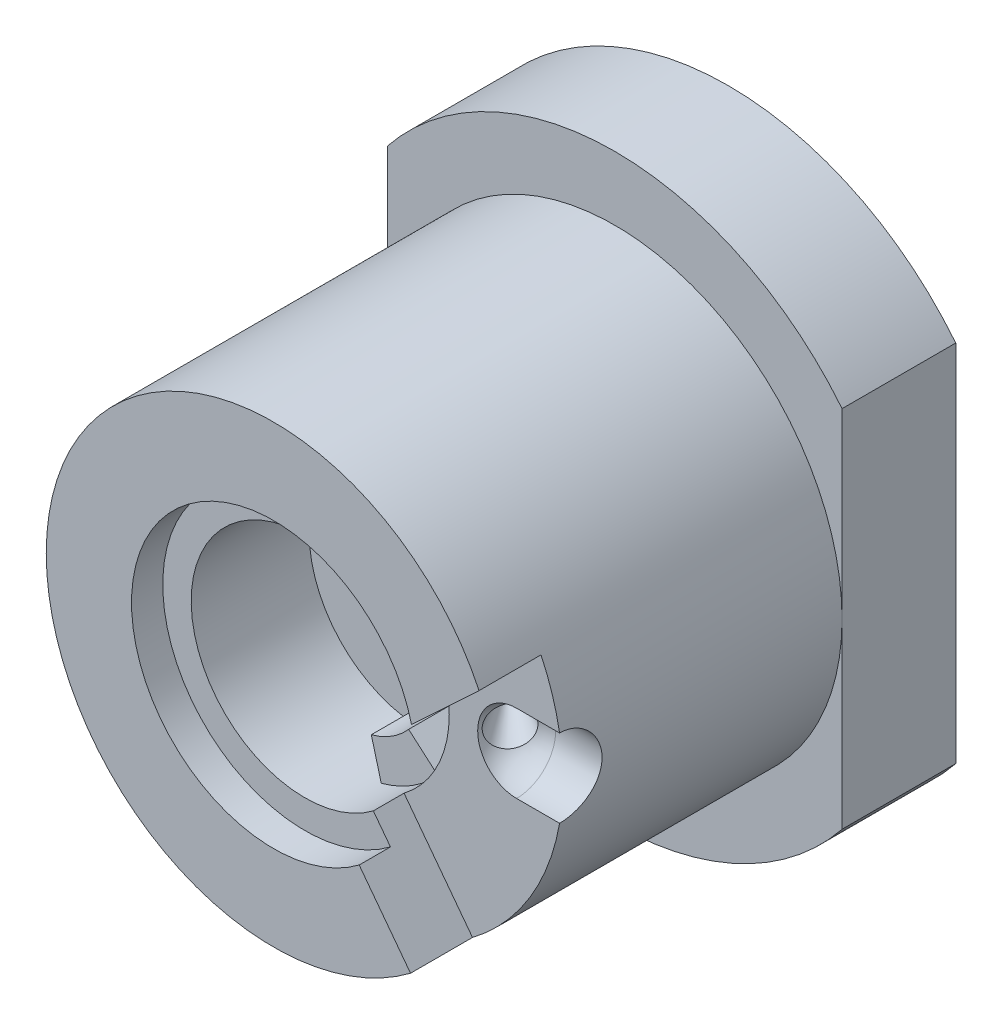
ISO-10303-21;
HEADER;
FILE_DESCRIPTION(('STEP AP214'),'2;1');
FILE_NAME('part.step','',(''),(''),'','','');
FILE_SCHEMA(('AUTOMOTIVE_DESIGN { 1 0 10303 214 1 1 1 1 }'));
ENDSEC;
DATA;
#1=APPLICATION_CONTEXT('core data for automotive mechanical design processes');
#2=APPLICATION_PROTOCOL_DEFINITION('international standard','automotive_design',2000,#1);
#3=PRODUCT_CONTEXT('',#1,'mechanical');
#4=PRODUCT('Part','Part','',(#3));
#5=PRODUCT_RELATED_PRODUCT_CATEGORY('part','',(#4));
#6=PRODUCT_DEFINITION_FORMATION('','',#4);
#7=PRODUCT_DEFINITION_CONTEXT('part definition',#1,'design');
#8=PRODUCT_DEFINITION('design','',#6,#7);
#9=PRODUCT_DEFINITION_SHAPE('','',#8);
#10=(LENGTH_UNIT() NAMED_UNIT(*) SI_UNIT(.MILLI.,.METRE.));
#11=(NAMED_UNIT(*) PLANE_ANGLE_UNIT() SI_UNIT($,.RADIAN.));
#12=(NAMED_UNIT(*) SI_UNIT($,.STERADIAN.) SOLID_ANGLE_UNIT());
#13=UNCERTAINTY_MEASURE_WITH_UNIT(LENGTH_MEASURE(1.E-05),#10,'distance_accuracy_value','');
#14=(GEOMETRIC_REPRESENTATION_CONTEXT(3) GLOBAL_UNCERTAINTY_ASSIGNED_CONTEXT((#13)) GLOBAL_UNIT_ASSIGNED_CONTEXT((#10,
#11,#12)) REPRESENTATION_CONTEXT('',''));
#15=CARTESIAN_POINT('',(0.,0.,0.));
#16=DIRECTION('',(0.,0.,1.));
#17=DIRECTION('',(1.,0.,0.));
#18=AXIS2_PLACEMENT_3D('',#15,#16,#17);
#19=CARTESIAN_POINT('',(0.,0.,13.5));
#20=DIRECTION('',(0.,0.,1.));
#21=DIRECTION('',(1.,0.,0.));
#22=AXIS2_PLACEMENT_3D('',#19,#20,#21);
#23=CYLINDRICAL_SURFACE('',#22,8.);
#24=DIRECTION('',(0.,0.,-1.));
#25=VECTOR('',#24,1.);
#26=CARTESIAN_POINT('',(6.03993550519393,-5.24587257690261,18.5));
#27=LINE('',#26,#25);
#28=CARTESIAN_POINT('',(6.03993550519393,-5.24587257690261,18.5));
#29=VERTEX_POINT('',#28);
#30=CARTESIAN_POINT('',(6.03993550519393,-5.24587257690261,13.5));
#31=VERTEX_POINT('',#30);
#32=EDGE_CURVE('E709',#29,#31,#27,.T.);
#33=ORIENTED_EDGE('',*,*,#32,.F.);
#34=CARTESIAN_POINT('',(0.,0.,18.5));
#35=DIRECTION('',(0.,0.,1.));
#36=DIRECTION('',(1.,0.,0.));
#37=AXIS2_PLACEMENT_3D('',#34,#35,#36);
#38=CIRCLE('',#37,8.);
#39=CARTESIAN_POINT('',(2.07387875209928,-7.72651453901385,18.5));
#40=VERTEX_POINT('',#39);
#41=EDGE_CURVE('E851',#40,#29,#38,.T.);
#42=ORIENTED_EDGE('',*,*,#41,.F.);
#43=DIRECTION('',(0.,0.,-1.));
#44=VECTOR('',#43,1.);
#45=CARTESIAN_POINT('',(2.07387875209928,-7.72651453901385,18.5));
#46=LINE('',#45,#44);
#47=CARTESIAN_POINT('',(2.07387875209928,-7.72651453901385,13.5));
#48=VERTEX_POINT('',#47);
#49=EDGE_CURVE('E842',#40,#48,#46,.T.);
#50=ORIENTED_EDGE('',*,*,#49,.T.);
#51=CARTESIAN_POINT('',(0.,0.,13.5));
#52=DIRECTION('',(0.,0.,1.));
#53=DIRECTION('',(1.,0.,0.));
#54=AXIS2_PLACEMENT_3D('',#51,#52,#53);
#55=CIRCLE('',#54,8.);
#56=EDGE_CURVE('E704',#31,#48,#55,.T.);
#57=ORIENTED_EDGE('',*,*,#56,.F.);
#58=EDGE_LOOP('',(#33,#42,#50,#57));
#59=FACE_BOUND('',#58,.T.);
#60=DIRECTION('',(0.,0.,1.));
#61=VECTOR('',#60,1.);
#62=CARTESIAN_POINT('',(7.96012546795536,0.797748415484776,13.5));
#63=LINE('',#62,#61);
#64=CARTESIAN_POINT('',(7.96012546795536,0.797748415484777,21.8));
#65=VERTEX_POINT('',#64);
#66=CARTESIAN_POINT('',(7.96012546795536,0.797748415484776,19.64));
#67=VERTEX_POINT('',#66);
#68=EDGE_CURVE('E700',#65,#67,#63,.F.);
#69=ORIENTED_EDGE('',*,*,#68,.F.);
#70=CARTESIAN_POINT('',(0.,0.,21.8));
#71=DIRECTION('',(0.,0.,1.));
#72=DIRECTION('',(1.,0.,0.));
#73=AXIS2_PLACEMENT_3D('',#70,#71,#72);
#74=CIRCLE('',#73,8.);
#75=CARTESIAN_POINT('',(4.81727018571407,-6.38701087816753,21.8));
#76=VERTEX_POINT('',#75);
#77=EDGE_CURVE('E690',#65,#76,#74,.T.);
#78=ORIENTED_EDGE('',*,*,#77,.T.);
#79=DIRECTION('',(0.,0.,1.));
#80=VECTOR('',#79,1.);
#81=CARTESIAN_POINT('',(4.81727018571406,-6.38701087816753,13.5));
#82=LINE('',#81,#80);
#83=CARTESIAN_POINT('',(4.81727018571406,-6.38701087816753,19.64));
#84=VERTEX_POINT('',#83);
#85=EDGE_CURVE('E703',#84,#76,#82,.T.);
#86=ORIENTED_EDGE('',*,*,#85,.F.);
#87=CARTESIAN_POINT('',(0.,0.,19.64));
#88=DIRECTION('',(0.,0.,-1.));
#89=DIRECTION('',(-1.,0.,0.));
#90=AXIS2_PLACEMENT_3D('',#87,#88,#89);
#91=CIRCLE('',#90,8.);
#92=EDGE_CURVE('E622',#67,#84,#91,.T.);
#93=ORIENTED_EDGE('',*,*,#92,.F.);
#94=EDGE_LOOP('',(#69,#78,#86,#93));
#95=FACE_BOUND('',#94,.T.);
#96=CARTESIAN_POINT('',(7.99834418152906,-0.162756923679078,15.030893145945));
#97=CARTESIAN_POINT('',(7.99804089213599,-0.17766315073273,15.0447095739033));
#98=CARTESIAN_POINT('',(7.99772346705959,-0.191230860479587,15.0599867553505));
#99=CARTESIAN_POINT('',(7.99709907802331,-0.215772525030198,15.0925420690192));
#100=CARTESIAN_POINT('',(7.99679216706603,-0.226734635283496,15.1098288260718));
#101=CARTESIAN_POINT('',(7.99609880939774,-0.250187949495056,15.1530490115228));
#102=CARTESIAN_POINT('',(7.99573098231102,-0.26147906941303,15.1796332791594));
#103=CARTESIAN_POINT('',(7.99511354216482,-0.279715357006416,15.2342207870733));
#104=CARTESIAN_POINT('',(7.99486404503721,-0.286656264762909,15.2622253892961));
#105=CARTESIAN_POINT('',(7.99445546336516,-0.297864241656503,15.3263707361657));
#106=CARTESIAN_POINT('',(7.99433726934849,-0.30095214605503,15.3627185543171));
#107=CARTESIAN_POINT('',(7.99433010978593,-0.301140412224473,15.4354406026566));
#108=CARTESIAN_POINT('',(7.99444128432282,-0.298237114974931,15.4718148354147));
#109=CARTESIAN_POINT('',(7.99484122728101,-0.287293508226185,15.5379271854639));
#110=CARTESIAN_POINT('',(7.99509942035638,-0.280129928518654,15.5678116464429));
#111=CARTESIAN_POINT('',(7.99574109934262,-0.26118279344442,15.6260731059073));
#112=CARTESIAN_POINT('',(7.99612431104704,-0.249409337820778,15.6544532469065));
#113=CARTESIAN_POINT('',(7.99681716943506,-0.225828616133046,15.6988258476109));
#114=CARTESIAN_POINT('',(7.99710424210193,-0.215533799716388,15.7156238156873));
#115=CARTESIAN_POINT('',(7.99768932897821,-0.192606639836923,15.7475567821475));
#116=CARTESIAN_POINT('',(7.99798732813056,-0.179977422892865,15.7626939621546));
#117=CARTESIAN_POINT('',(7.99849252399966,-0.155647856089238,15.7870791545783));
#118=CARTESIAN_POINT('',(7.99870401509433,-0.144484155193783,15.7968596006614));
#119=CARTESIAN_POINT('',(7.99909750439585,-0.120745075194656,15.8145354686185));
#120=CARTESIAN_POINT('',(7.99927954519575,-0.108171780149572,15.8224336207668));
#121=CARTESIAN_POINT('',(7.9995627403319,-0.084317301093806,15.8344884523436));
#122=CARTESIAN_POINT('',(7.99967272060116,-0.0732536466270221,15.8390727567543));
#123=CARTESIAN_POINT('',(7.9998485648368,-0.0505148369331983,15.8463370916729));
#124=CARTESIAN_POINT('',(7.99991446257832,-0.0388401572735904,15.8490185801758));
#125=CARTESIAN_POINT('',(7.99999446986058,-0.0151427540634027,15.8522682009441));
#126=CARTESIAN_POINT('',(8.00000835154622,-0.00311873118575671,15.8528270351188));
#127=CARTESIAN_POINT('',(7.99998184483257,0.020830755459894,15.8517542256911));
#128=CARTESIAN_POINT('',(7.99994145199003,0.0327562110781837,15.8501224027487));
#129=CARTESIAN_POINT('',(7.99981588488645,0.0553669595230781,15.8449876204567));
#130=CARTESIAN_POINT('',(7.99973381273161,0.0660823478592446,15.8416140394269));
#131=CARTESIAN_POINT('',(7.99953496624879,0.0868834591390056,15.833305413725));
#132=CARTESIAN_POINT('',(7.99941817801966,0.0969689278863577,15.8283697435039));
#133=CARTESIAN_POINT('',(7.99910343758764,0.120571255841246,15.8147794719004));
#134=CARTESIAN_POINT('',(7.99889220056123,0.133692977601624,15.8054389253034));
#135=CARTESIAN_POINT('',(7.9984437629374,0.158269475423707,15.784776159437));
#136=CARTESIAN_POINT('',(7.99820650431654,0.169720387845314,15.7734494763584));
#137=CARTESIAN_POINT('',(7.99761972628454,0.195747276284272,15.7439749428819));
#138=CARTESIAN_POINT('',(7.99726745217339,0.209430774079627,15.7250418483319));
#139=CARTESIAN_POINT('',(7.99659548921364,0.233681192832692,15.6852909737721));
#140=CARTESIAN_POINT('',(7.99627586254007,0.244242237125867,15.6644697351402));
#141=CARTESIAN_POINT('',(7.9955733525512,0.266419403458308,15.6125406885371));
#142=CARTESIAN_POINT('',(7.9952210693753,0.276585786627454,15.5808131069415));
#143=CARTESIAN_POINT('',(7.99468228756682,0.291736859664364,15.5161537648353));
#144=CARTESIAN_POINT('',(7.99449598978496,0.296715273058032,15.4832205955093));
#145=CARTESIAN_POINT('',(7.99430790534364,0.301741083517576,15.416236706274));
#146=CARTESIAN_POINT('',(7.99431035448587,0.301675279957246,15.3821774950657));
#147=CARTESIAN_POINT('',(7.99451468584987,0.296215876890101,15.314491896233));
#148=CARTESIAN_POINT('',(7.99471637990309,0.290827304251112,15.2808651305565));
#149=CARTESIAN_POINT('',(7.99523035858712,0.276277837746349,15.2229300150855));
#150=CARTESIAN_POINT('',(7.99550465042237,0.268327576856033,15.1983166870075));
#151=CARTESIAN_POINT('',(7.99613711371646,0.248773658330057,15.1505753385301));
#152=CARTESIAN_POINT('',(7.99649515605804,0.237175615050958,15.1274451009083));
#153=CARTESIAN_POINT('',(7.9971471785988,0.213846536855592,15.0899457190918));
#154=CARTESIAN_POINT('',(7.99743017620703,0.203103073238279,15.074963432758));
#155=CARTESIAN_POINT('',(7.99799621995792,0.179433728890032,15.0468249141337));
#156=CARTESIAN_POINT('',(7.99827926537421,0.16651118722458,15.033665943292));
#157=CARTESIAN_POINT('',(7.99875298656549,0.141660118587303,15.0126235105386));
#158=CARTESIAN_POINT('',(7.9989500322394,0.130173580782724,15.0042208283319));
#159=CARTESIAN_POINT('',(7.99930708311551,0.105981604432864,14.9893812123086));
#160=CARTESIAN_POINT('',(7.99946710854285,0.0932768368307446,14.9829432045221));
#161=CARTESIAN_POINT('',(7.99973241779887,0.0667685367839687,14.9724330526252));
#162=CARTESIAN_POINT('',(7.99983717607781,0.0529558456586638,14.9683835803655));
#163=CARTESIAN_POINT('',(7.99997388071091,0.0248011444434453,14.9631226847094));
#164=CARTESIAN_POINT('',(8.00000590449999,0.0104597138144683,14.9619082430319));
#165=CARTESIAN_POINT('',(7.9999932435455,-0.016063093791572,14.962392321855));
#166=CARTESIAN_POINT('',(7.99995909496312,-0.0282535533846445,14.9636907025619));
#167=CARTESIAN_POINT('',(7.99983843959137,-0.0522377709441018,14.9683359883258));
#168=CARTESIAN_POINT('',(7.99975191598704,-0.0640314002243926,14.9716835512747));
#169=CARTESIAN_POINT('',(7.99953660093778,-0.0868558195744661,14.9801756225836));
#170=CARTESIAN_POINT('',(7.9994080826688,-0.0978909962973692,14.9853085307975));
#171=CARTESIAN_POINT('',(7.99912044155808,-0.119099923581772,14.9970941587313));
#172=CARTESIAN_POINT('',(7.99896133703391,-0.129274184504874,15.0037459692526));
#173=CARTESIAN_POINT('',(7.99864904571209,-0.147247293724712,15.0172162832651));
#174=CARTESIAN_POINT('',(7.99849844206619,-0.155175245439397,15.0238657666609));
#175=CARTESIAN_POINT('',(7.99834418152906,-0.162756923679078,15.030893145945));
#176=B_SPLINE_CURVE_WITH_KNOTS('',3,(#96,#97,#98,#99,#100,#101,#102,#103,#104,#105,#106,#107,
#108,#109,#110,#111,#112,#113,#114,#115,#116,#117,#118,#119,#120,#121,#122,#123,#124,#125,#126,
#127,#128,#129,#130,#131,#132,#133,#134,#135,#136,#137,#138,#139,#140,#141,#142,#143,#144,#145,
#146,#147,#148,#149,#150,#151,#152,#153,#154,#155,#156,#157,#158,#159,#160,#161,#162,#163,#164,
#165,#166,#167,#168,#169,#170,#171,#172,#173,#174,#175),.UNSPECIFIED.,.T.,.F.,(4,2,2,2,2,2,2,2,
2,2,2,2,2,2,2,2,2,2,2,2,2,2,2,2,2,2,2,2,2,2,2,2,2,2,2,2,2,2,2,4),(0.,0.0609429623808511,
0.122157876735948,0.208341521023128,0.294609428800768,0.403509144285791,0.512475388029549,
0.604358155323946,0.696040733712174,0.75499410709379,0.813869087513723,0.85825101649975,
0.90256817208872,0.938350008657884,0.974104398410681,1.01001522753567,1.04592899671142,
1.07949355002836,1.11307156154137,1.16112539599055,1.20928864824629,1.27899025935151,
1.34882223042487,1.44824942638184,1.54779677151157,1.64957876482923,1.75126472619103,
1.82862776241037,1.90587230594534,1.96101507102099,2.0160740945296,2.0586150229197,
2.10113265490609,2.14404762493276,2.18691688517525,2.22351492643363,2.26012472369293,
2.29650096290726,2.332855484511,2.3638525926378),.UNSPECIFIED.);
#177=CARTESIAN_POINT('',(7.99834418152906,-0.162756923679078,15.030893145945));
#178=VERTEX_POINT('',#177);
#179=EDGE_CURVE('E516',#178,#178,#176,.T.);
#180=ORIENTED_EDGE('',*,*,#179,.F.);
#181=EDGE_LOOP('',(#180));
#182=FACE_BOUND('',#181,.T.);
#183=ADVANCED_FACE('F367',(#59,#95,#182),#23,.F.);
#184=CARTESIAN_POINT('',(12.74,0.,19.64));
#185=DIRECTION('',(-1.,0.,0.));
#186=DIRECTION('',(0.,0.,1.));
#187=AXIS2_PLACEMENT_3D('',#184,#185,#186);
#188=DEGENERATE_TOROIDAL_SURFACE('',#187,0.00999999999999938,2.74,.T.);
#189=CARTESIAN_POINT('',(12.74,-0.00999999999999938,19.64));
#190=DIRECTION('',(0.,0.,-1.));
#191=DIRECTION('',(-1.,0.,0.));
#192=AXIS2_PLACEMENT_3D('',#189,#190,#191);
#193=CIRCLE('',#192,2.74);
#194=CARTESIAN_POINT('',(10.,-0.00999999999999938,19.64));
#195=VERTEX_POINT('',#194);
#196=CARTESIAN_POINT('',(12.74,-2.75,19.64));
#197=VERTEX_POINT('',#196);
#198=EDGE_CURVE('E510',#195,#197,#193,.F.);
#199=ORIENTED_EDGE('',*,*,#198,.T.);
#200=CARTESIAN_POINT('',(12.74,0.,19.64));
#201=DIRECTION('',(-1.,0.,0.));
#202=DIRECTION('',(0.,0.,1.));
#203=AXIS2_PLACEMENT_3D('',#200,#201,#202);
#204=CIRCLE('',#203,2.75);
#205=CARTESIAN_POINT('',(12.74,2.75,19.64));
#206=VERTEX_POINT('',#205);
#207=EDGE_CURVE('E498',#206,#197,#204,.T.);
#208=ORIENTED_EDGE('',*,*,#207,.F.);
#209=CARTESIAN_POINT('',(12.74,0.00999999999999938,19.64));
#210=DIRECTION('',(0.,0.,1.));
#211=DIRECTION('',(0.,1.,0.));
#212=AXIS2_PLACEMENT_3D('',#209,#210,#211);
#213=CIRCLE('',#212,2.74);
#214=CARTESIAN_POINT('',(10.,0.00999999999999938,19.64));
#215=VERTEX_POINT('',#214);
#216=EDGE_CURVE('E508',#206,#215,#213,.T.);
#217=ORIENTED_EDGE('',*,*,#216,.T.);
#218=CARTESIAN_POINT('',(10.,0.,19.64));
#219=DIRECTION('',(-1.,0.,0.));
#220=DIRECTION('',(0.,0.,1.));
#221=AXIS2_PLACEMENT_3D('',#218,#219,#220);
#222=CIRCLE('',#221,0.00999999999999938);
#223=EDGE_CURVE('E511',#215,#195,#222,.T.);
#224=ORIENTED_EDGE('',*,*,#223,.T.);
#225=EDGE_LOOP('',(#199,#208,#217,#224));
#226=FACE_BOUND('',#225,.T.);
#227=CARTESIAN_POINT('',(11.3229011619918,-1.14462143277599,17.5817788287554));
#228=CARTESIAN_POINT('',(11.2765032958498,-1.19590972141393,17.6423873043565));
#229=CARTESIAN_POINT('',(11.2270144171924,-1.23973088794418,17.7071749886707));
#230=CARTESIAN_POINT('',(11.1239182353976,-1.31068337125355,17.8425331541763));
#231=CARTESIAN_POINT('',(11.0703024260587,-1.33777911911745,17.9131156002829));
#232=CARTESIAN_POINT('',(10.968877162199,-1.37167909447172,18.0470704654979));
#233=CARTESIAN_POINT('',(10.9213175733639,-1.38080929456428,18.1100526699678));
#234=CARTESIAN_POINT('',(10.8261686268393,-1.38580309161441,18.2364358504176));
#235=CARTESIAN_POINT('',(10.7785793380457,-1.38167902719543,18.2998363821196));
#236=CARTESIAN_POINT('',(10.6842589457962,-1.36022321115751,18.4258972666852));
#237=CARTESIAN_POINT('',(10.6375388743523,-1.34277714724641,18.488546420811));
#238=CARTESIAN_POINT('',(10.5466989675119,-1.295016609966,18.6107723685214));
#239=CARTESIAN_POINT('',(10.5025796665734,-1.26469950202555,18.6703485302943));
#240=CARTESIAN_POINT('',(10.418192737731,-1.19201020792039,18.7847032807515));
#241=CARTESIAN_POINT('',(10.3779257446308,-1.14963603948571,18.8394810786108));
#242=CARTESIAN_POINT('',(10.302402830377,-1.05399018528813,18.9425980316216));
#243=CARTESIAN_POINT('',(10.2671465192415,-1.00071934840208,18.9909376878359));
#244=CARTESIAN_POINT('',(10.2029297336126,-0.885236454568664,19.0793271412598));
#245=CARTESIAN_POINT('',(10.173919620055,-0.823101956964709,19.1194421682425));
#246=CARTESIAN_POINT('',(10.1226706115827,-0.691299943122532,19.1906168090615));
#247=CARTESIAN_POINT('',(10.1004317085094,-0.621632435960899,19.2216764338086));
#248=CARTESIAN_POINT('',(10.0636398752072,-0.477793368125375,19.2733361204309));
#249=CARTESIAN_POINT('',(10.0489831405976,-0.403699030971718,19.2940772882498));
#250=CARTESIAN_POINT('',(10.0272996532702,-0.25227130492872,19.325021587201));
#251=CARTESIAN_POINT('',(10.0202710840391,-0.174938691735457,19.3352272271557));
#252=CARTESIAN_POINT('',(10.0139426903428,-0.0205609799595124,19.3443992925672));
#253=CARTESIAN_POINT('',(10.0145189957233,0.0564683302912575,19.3435458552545));
#254=CARTESIAN_POINT('',(10.0231095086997,0.209234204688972,19.3311128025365));
#255=CARTESIAN_POINT('',(10.0311241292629,0.284970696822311,19.3195325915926));
#256=CARTESIAN_POINT('',(10.0543909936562,0.432357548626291,19.2864151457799));
#257=CARTESIAN_POINT('',(10.0695793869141,0.504037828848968,19.2649657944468));
#258=CARTESIAN_POINT('',(10.1067559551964,0.642078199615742,19.2128385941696));
#259=CARTESIAN_POINT('',(10.1287442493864,0.708438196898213,19.1821605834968));
#260=CARTESIAN_POINT('',(10.1793609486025,0.835167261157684,19.1119123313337));
#261=CARTESIAN_POINT('',(10.2080974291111,0.895413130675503,19.0721977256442));
#262=CARTESIAN_POINT('',(10.2711963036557,1.00697435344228,18.9853825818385));
#263=CARTESIAN_POINT('',(10.3055592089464,1.05828889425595,18.9382813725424));
#264=CARTESIAN_POINT('',(10.379526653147,1.15133973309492,18.8373027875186));
#265=CARTESIAN_POINT('',(10.4192019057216,1.19292128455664,18.7833345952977));
#266=CARTESIAN_POINT('',(10.5022898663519,1.26440771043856,18.6707423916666));
#267=CARTESIAN_POINT('',(10.5457028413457,1.29431175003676,18.6121180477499));
#268=CARTESIAN_POINT('',(10.6356150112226,1.34194201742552,18.4911297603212));
#269=CARTESIAN_POINT('',(10.6821450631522,1.35951733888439,18.4287292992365));
#270=CARTESIAN_POINT('',(10.7765067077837,1.38142186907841,18.3026000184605));
#271=CARTESIAN_POINT('',(10.8243383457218,1.38575061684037,18.2388711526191));
#272=CARTESIAN_POINT('',(10.9201721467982,1.38101382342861,18.1115700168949));
#273=CARTESIAN_POINT('',(10.9681740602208,1.3718854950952,18.047999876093));
#274=CARTESIAN_POINT('',(11.0627291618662,1.34033879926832,17.9231169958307));
#275=CARTESIAN_POINT('',(11.1092823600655,1.317920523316,17.8618042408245));
#276=CARTESIAN_POINT('',(11.199399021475,1.26048289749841,17.743397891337));
#277=CARTESIAN_POINT('',(11.2429725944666,1.22550896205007,17.6862899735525));
#278=CARTESIAN_POINT('',(11.3259992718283,1.14388878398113,17.5776940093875));
#279=CARTESIAN_POINT('',(11.3654525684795,1.09724308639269,17.5262057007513));
#280=CARTESIAN_POINT('',(11.4386778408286,0.994060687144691,17.4308020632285));
#281=CARTESIAN_POINT('',(11.47249954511,0.937620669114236,17.3868203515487));
#282=CARTESIAN_POINT('',(11.533857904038,0.816136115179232,17.3071326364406));
#283=CARTESIAN_POINT('',(11.5613949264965,0.751092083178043,17.2714261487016));
#284=CARTESIAN_POINT('',(11.6090494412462,0.615018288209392,17.2096908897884));
#285=CARTESIAN_POINT('',(11.6292454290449,0.54406247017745,17.1835597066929));
#286=CARTESIAN_POINT('',(11.662004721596,0.397580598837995,17.1411966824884));
#287=CARTESIAN_POINT('',(11.6745683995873,0.322054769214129,17.1249643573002));
#288=CARTESIAN_POINT('',(11.6915902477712,0.169278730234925,17.1029764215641));
#289=CARTESIAN_POINT('',(11.6961174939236,0.0920490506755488,17.0971315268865));
#290=CARTESIAN_POINT('',(11.6971365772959,-0.0625458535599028,17.095815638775));
#291=CARTESIAN_POINT('',(11.6936291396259,-0.139911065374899,17.1003437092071));
#292=CARTESIAN_POINT('',(11.6787187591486,-0.292289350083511,17.1196024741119));
#293=CARTESIAN_POINT('',(11.6673448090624,-0.367310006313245,17.1342957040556));
#294=CARTESIAN_POINT('',(11.6370784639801,-0.513209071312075,17.1734273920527));
#295=CARTESIAN_POINT('',(11.6181832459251,-0.584085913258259,17.1978695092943));
#296=CARTESIAN_POINT('',(11.5733872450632,-0.719908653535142,17.2558834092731));
#297=CARTESIAN_POINT('',(11.5474631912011,-0.784833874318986,17.2894855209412));
#298=CARTESIAN_POINT('',(11.4894536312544,-0.906619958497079,17.3647886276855));
#299=CARTESIAN_POINT('',(11.4573788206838,-0.963494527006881,17.406475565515));
#300=CARTESIAN_POINT('',(11.407088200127,-1.03909760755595,17.471954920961));
#301=CARTESIAN_POINT('',(11.3909181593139,-1.06164105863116,17.4930239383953));
#302=CARTESIAN_POINT('',(11.3576138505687,-1.10468775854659,17.5364547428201));
#303=CARTESIAN_POINT('',(11.3404793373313,-1.12519048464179,17.558816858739));
#304=CARTESIAN_POINT('',(11.3229011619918,-1.14462143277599,17.5817788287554));
#305=B_SPLINE_CURVE_WITH_KNOTS('',3,(#227,#228,#229,#230,#231,#232,#233,#234,#235,#236,#237,
#238,#239,#240,#241,#242,#243,#244,#245,#246,#247,#248,#249,#250,#251,#252,#253,#254,#255,#256,
#257,#258,#259,#260,#261,#262,#263,#264,#265,#266,#267,#268,#269,#270,#271,#272,#273,#274,#275,
#276,#277,#278,#279,#280,#281,#282,#283,#284,#285,#286,#287,#288,#289,#290,#291,#292,#293,#294,
#295,#296,#297,#298,#299,#300,#301,#302,#303,#304),.UNSPECIFIED.,.T.,.F.,(4,2,2,2,2,2,2,2,2,2,2,
2,2,2,2,2,2,2,2,2,2,2,2,2,2,2,2,2,2,2,2,2,2,2,2,2,2,2,4),(0.,0.275706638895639,
0.551997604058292,0.789253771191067,1.02628913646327,1.26538161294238,1.50452305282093,
1.7437038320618,1.98286598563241,2.2200509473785,2.4572356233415,2.69108091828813,
2.9248705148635,3.15485685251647,3.38485595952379,3.61284545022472,3.84083893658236,
4.07276827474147,4.30471869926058,4.54013851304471,4.77557515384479,5.01384554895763,
5.25212423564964,5.49151819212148,5.73091049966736,5.96944549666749,6.20796935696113,
6.44426025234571,6.68053731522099,6.91420795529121,7.14786716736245,7.37950808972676,
7.6111281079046,7.84189898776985,8.0727565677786,8.30438800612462,8.53562025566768,
8.64004707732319,8.74450058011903),.UNSPECIFIED.);
#306=CARTESIAN_POINT('',(11.3229011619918,-1.14462143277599,17.5817788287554));
#307=VERTEX_POINT('',#306);
#308=EDGE_CURVE('E372',#307,#307,#305,.T.);
#309=ORIENTED_EDGE('',*,*,#308,.T.);
#310=EDGE_LOOP('',(#309));
#311=FACE_BOUND('',#310,.T.);
#312=ADVANCED_FACE('F505',(#226,#311),#188,.F.);
#313=CARTESIAN_POINT('',(0.,0.,24.));
#314=DIRECTION('',(0.,0.,-1.));
#315=DIRECTION('',(-1.,0.,0.));
#316=AXIS2_PLACEMENT_3D('',#313,#314,#315);
#317=CYLINDRICAL_SURFACE('',#316,16.);
#318=CARTESIAN_POINT('',(0.,0.,0.));
#319=DIRECTION('',(0.,0.,-1.));
#320=DIRECTION('',(-1.,0.,0.));
#321=AXIS2_PLACEMENT_3D('',#318,#319,#320);
#322=CIRCLE('',#321,16.);
#323=CARTESIAN_POINT('',(16.,0.,0.));
#324=VERTEX_POINT('',#323);
#325=CARTESIAN_POINT('',(-16.,0.,0.));
#326=VERTEX_POINT('',#325);
#327=EDGE_CURVE('E682',#324,#326,#322,.T.);
#328=ORIENTED_EDGE('',*,*,#327,.F.);
#329=EDGE_CURVE('E681',#326,#324,#322,.T.);
#330=ORIENTED_EDGE('',*,*,#329,.F.);
#331=EDGE_LOOP('',(#328,#330));
#332=FACE_BOUND('',#331,.T.);
#333=CARTESIAN_POINT('',(15.763722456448,-2.7395354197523,19.8796782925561));
#334=CARTESIAN_POINT('',(15.7625576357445,-2.7462135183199,19.8034398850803));
#335=CARTESIAN_POINT('',(15.7619526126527,-2.74969352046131,19.7269166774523));
#336=CARTESIAN_POINT('',(15.7618547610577,-2.75026726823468,19.5738516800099));
#337=CARTESIAN_POINT('',(15.7623618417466,-2.74736153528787,19.4973098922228));
#338=CARTESIAN_POINT('',(15.7644792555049,-2.73518262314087,19.3448436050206));
#339=CARTESIAN_POINT('',(15.7660881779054,-2.72591758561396,19.2689184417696));
#340=CARTESIAN_POINT('',(15.7703562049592,-2.70111435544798,19.1181513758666));
#341=CARTESIAN_POINT('',(15.7730153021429,-2.68557620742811,19.0433094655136));
#342=CARTESIAN_POINT('',(15.7824656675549,-2.62968757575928,18.82115356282));
#343=CARTESIAN_POINT('',(15.7907313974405,-2.58005557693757,18.6761189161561));
#344=CARTESIAN_POINT('',(15.8102553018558,-2.45756684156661,18.3965387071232));
#345=CARTESIAN_POINT('',(15.8215134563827,-2.38471026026,18.2619930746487));
#346=CARTESIAN_POINT('',(15.8458655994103,-2.21714847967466,18.0058818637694));
#347=CARTESIAN_POINT('',(15.8589735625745,-2.1222730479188,17.8844288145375));
#348=CARTESIAN_POINT('',(15.8855008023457,-1.91360941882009,17.659041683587));
#349=CARTESIAN_POINT('',(15.8989201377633,-1.79981762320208,17.5551109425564));
#350=CARTESIAN_POINT('',(15.9247185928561,-1.55518146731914,17.3666803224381));
#351=CARTESIAN_POINT('',(15.9370859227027,-1.42417744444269,17.2823858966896));
#352=CARTESIAN_POINT('',(15.9592355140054,-1.14966769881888,17.1370255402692));
#353=CARTESIAN_POINT('',(15.9690180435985,-1.00616327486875,17.0759571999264));
#354=CARTESIAN_POINT('',(15.9848426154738,-0.711623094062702,16.9791781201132));
#355=CARTESIAN_POINT('',(15.9909072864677,-0.560639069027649,16.9433137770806));
#356=CARTESIAN_POINT('',(15.9987043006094,-0.25468326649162,16.8974537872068));
#357=CARTESIAN_POINT('',(16.00043690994,-0.0997117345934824,16.8874565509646));
#358=CARTESIAN_POINT('',(15.9993807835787,0.207744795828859,16.8936042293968));
#359=CARTESIAN_POINT('',(15.9966484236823,0.36023662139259,16.9094231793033));
#360=CARTESIAN_POINT('',(15.9870723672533,0.660353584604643,16.9660976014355));
#361=CARTESIAN_POINT('',(15.9802287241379,0.807978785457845,17.0069527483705));
#362=CARTESIAN_POINT('',(15.9631796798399,1.09429867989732,17.1124910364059));
#363=CARTESIAN_POINT('',(15.9529729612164,1.23298984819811,17.1771835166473));
#364=CARTESIAN_POINT('',(15.9303105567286,1.49762036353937,17.3285345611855));
#365=CARTESIAN_POINT('',(15.9178546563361,1.62355849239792,17.4151952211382));
#366=CARTESIAN_POINT('',(15.8918793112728,1.86081056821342,17.6093170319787));
#367=CARTESIAN_POINT('',(15.8783484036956,1.97191931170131,17.7170274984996));
#368=CARTESIAN_POINT('',(15.8518668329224,2.17457813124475,17.9495864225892));
#369=CARTESIAN_POINT('',(15.8389162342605,2.26612603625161,18.0744367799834));
#370=CARTESIAN_POINT('',(15.814981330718,2.42756861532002,18.3386430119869));
#371=CARTESIAN_POINT('',(15.8040093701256,2.49732921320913,18.4780819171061));
#372=CARTESIAN_POINT('',(15.7854086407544,2.61233512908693,18.7668921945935));
#373=CARTESIAN_POINT('',(15.7777773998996,2.65759858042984,18.9162561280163));
#374=CARTESIAN_POINT('',(15.7688581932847,2.70989161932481,19.1622637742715));
#375=CARTESIAN_POINT('',(15.7662605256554,2.72492260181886,19.2572325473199));
#376=CARTESIAN_POINT('',(15.7627772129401,2.74497497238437,19.4481192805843));
#377=CARTESIAN_POINT('',(15.7618892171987,2.75001010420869,19.5440357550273));
#378=CARTESIAN_POINT('',(15.7619002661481,2.75,19.64));
#379=B_SPLINE_CURVE_WITH_KNOTS('',3,(#333,#334,#335,#336,#337,#338,#339,#340,#341,#342,#343,
#344,#345,#346,#347,#348,#349,#350,#351,#352,#353,#354,#355,#356,#357,#358,#359,#360,#361,#362,
#363,#364,#365,#366,#367,#368,#369,#370,#371,#372,#373,#374,#375,#376,#377,#378),.UNSPECIFIED.,
.F.,.F.,(4,2,2,2,2,2,2,2,2,2,2,2,2,2,2,2,2,2,2,2,2,2,4),(0.,0.229542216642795,0.459065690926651,
0.688295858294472,0.917524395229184,1.37571253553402,1.83389761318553,2.29575052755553,
2.75769139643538,3.22426781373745,3.69079581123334,4.15445534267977,4.6180863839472,
5.07590860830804,5.5337248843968,5.99172071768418,6.44976025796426,6.91359540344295,
7.37748200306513,7.84416947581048,8.31051102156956,8.59857133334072,8.88623530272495),.UNSPECIFIED.);
#380=CARTESIAN_POINT('',(15.7619002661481,-2.75,19.64));
#381=VERTEX_POINT('',#380);
#382=CARTESIAN_POINT('',(15.7619002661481,2.75,19.64));
#383=VERTEX_POINT('',#382);
#384=EDGE_CURVE('E387',#381,#383,#379,.T.);
#385=ORIENTED_EDGE('',*,*,#384,.F.);
#386=CARTESIAN_POINT('',(0.,0.,19.64));
#387=DIRECTION('',(0.,0.,1.));
#388=DIRECTION('',(-1.,0.,0.));
#389=AXIS2_PLACEMENT_3D('',#386,#387,#388);
#390=CIRCLE('',#389,16.);
#391=CARTESIAN_POINT('',(9.63454037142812,-12.7740217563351,19.64));
#392=VERTEX_POINT('',#391);
#393=EDGE_CURVE('E638',#392,#381,#390,.T.);
#394=ORIENTED_EDGE('',*,*,#393,.F.);
#395=DIRECTION('',(0.,0.,1.));
#396=VECTOR('',#395,1.);
#397=CARTESIAN_POINT('',(9.63454037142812,-12.7740217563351,19.64));
#398=LINE('',#397,#396);
#399=CARTESIAN_POINT('',(9.63454037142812,-12.7740217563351,24.));
#400=VERTEX_POINT('',#399);
#401=EDGE_CURVE('E646',#392,#400,#398,.T.);
#402=ORIENTED_EDGE('',*,*,#401,.T.);
#403=CARTESIAN_POINT('',(0.,0.,24.));
#404=DIRECTION('',(0.,0.,1.));
#405=DIRECTION('',(1.,0.,0.));
#406=AXIS2_PLACEMENT_3D('',#403,#404,#405);
#407=CIRCLE('',#406,16.);
#408=CARTESIAN_POINT('',(14.4549903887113,6.85953736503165,24.));
#409=VERTEX_POINT('',#408);
#410=EDGE_CURVE('E685',#409,#400,#407,.T.);
#411=ORIENTED_EDGE('',*,*,#410,.F.);
#412=DIRECTION('',(0.,0.,1.));
#413=VECTOR('',#412,1.);
#414=CARTESIAN_POINT('',(14.4549903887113,6.85953736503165,19.64));
#415=LINE('',#414,#413);
#416=CARTESIAN_POINT('',(14.4549903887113,6.85953736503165,19.64));
#417=VERTEX_POINT('',#416);
#418=EDGE_CURVE('E629',#417,#409,#415,.T.);
#419=ORIENTED_EDGE('',*,*,#418,.F.);
#420=EDGE_CURVE('E632',#383,#417,#390,.T.);
#421=ORIENTED_EDGE('',*,*,#420,.F.);
#422=EDGE_LOOP('',(#385,#394,#402,#411,#419,#421));
#423=FACE_BOUND('',#422,.T.);
#424=ADVANCED_FACE('F369',(#332,#423),#317,.T.);
#425=CARTESIAN_POINT('',(0.,0.,19.64));
#426=DIRECTION('',(0.,0.,-1.));
#427=DIRECTION('',(-1.,0.,0.));
#428=AXIS2_PLACEMENT_3D('',#425,#426,#427);
#429=PLANE('',#428);
#430=DIRECTION('',(0.,-1.,0.));
#431=VECTOR('',#430,1.);
#432=CARTESIAN_POINT('',(10.,0.,19.64));
#433=LINE('',#432,#431);
#434=EDGE_CURVE('E514',#215,#195,#433,.T.);
#435=ORIENTED_EDGE('',*,*,#434,.F.);
#436=ORIENTED_EDGE('',*,*,#216,.F.);
#437=DIRECTION('',(-1.,0.,0.));
#438=VECTOR('',#437,1.);
#439=CARTESIAN_POINT('',(9.07430256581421,2.75,19.64));
#440=LINE('',#439,#438);
#441=EDGE_CURVE('E11',#383,#206,#440,.T.);
#442=ORIENTED_EDGE('',*,*,#441,.F.);
#443=ORIENTED_EDGE('',*,*,#420,.T.);
#444=DIRECTION('',(-0.731060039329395,-0.682313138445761,0.));
#445=VECTOR('',#444,1.);
#446=CARTESIAN_POINT('',(6.47316177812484,-0.590064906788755,19.64));
#447=LINE('',#446,#445);
#448=EDGE_CURVE('E641',#417,#67,#447,.T.);
#449=ORIENTED_EDGE('',*,*,#448,.T.);
#450=ORIENTED_EDGE('',*,*,#92,.T.);
#451=DIRECTION('',(0.602158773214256,-0.798376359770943,0.));
#452=VECTOR('',#451,1.);
#453=CARTESIAN_POINT('',(3.91403202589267,-5.18944633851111,19.64));
#454=LINE('',#453,#452);
#455=EDGE_CURVE('E644',#84,#392,#454,.T.);
#456=ORIENTED_EDGE('',*,*,#455,.T.);
#457=ORIENTED_EDGE('',*,*,#393,.T.);
#458=DIRECTION('',(-1.,0.,0.));
#459=VECTOR('',#458,1.);
#460=CARTESIAN_POINT('',(9.07430256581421,-2.75,19.64));
#461=LINE('',#460,#459);
#462=EDGE_CURVE('E381',#197,#381,#461,.F.);
#463=ORIENTED_EDGE('',*,*,#462,.F.);
#464=ORIENTED_EDGE('',*,*,#198,.F.);
#465=EDGE_LOOP('',(#435,#436,#442,#443,#449,#450,#456,#457,#463,#464));
#466=FACE_BOUND('',#465,.T.);
#467=ADVANCED_FACE('F513',(#466),#429,.F.);
#468=CARTESIAN_POINT('',(0.,0.,13.5));
#469=DIRECTION('',(0.,0.,1.));
#470=DIRECTION('',(1.,0.,0.));
#471=AXIS2_PLACEMENT_3D('',#468,#469,#470);
#472=PLANE('',#471);
#473=CARTESIAN_POINT('',(0.,0.,13.5));
#474=DIRECTION('',(0.,0.,-1.));
#475=DIRECTION('',(1.,0.,0.));
#476=AXIS2_PLACEMENT_3D('',#473,#474,#475);
#477=CIRCLE('',#476,5.3);
#478=CARTESIAN_POINT('',(4.00145727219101,-3.47539058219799,13.5));
#479=VERTEX_POINT('',#478);
#480=CARTESIAN_POINT('',(1.3739446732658,-5.11881588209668,13.5));
#481=VERTEX_POINT('',#480);
#482=EDGE_CURVE('E855',#479,#481,#477,.T.);
#483=ORIENTED_EDGE('',*,*,#482,.F.);
#484=DIRECTION('',(-0.754991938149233,0.655734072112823,0.));
#485=VECTOR('',#484,1.);
#486=CARTESIAN_POINT('',(4.00145727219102,-3.475390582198,13.5));
#487=LINE('',#486,#485);
#488=EDGE_CURVE('E530',#31,#479,#487,.T.);
#489=ORIENTED_EDGE('',*,*,#488,.F.);
#490=ORIENTED_EDGE('',*,*,#56,.T.);
#491=DIRECTION('',(0.259234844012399,-0.965814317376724,0.));
#492=VECTOR('',#491,1.);
#493=CARTESIAN_POINT('',(2.07387875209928,-7.72651453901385,13.5));
#494=LINE('',#493,#492);
#495=EDGE_CURVE('E854',#481,#48,#494,.T.);
#496=ORIENTED_EDGE('',*,*,#495,.F.);
#497=EDGE_LOOP('',(#483,#489,#490,#496));
#498=FACE_BOUND('',#497,.T.);
#499=ADVANCED_FACE('F559',(#498),#472,.T.);
#500=CARTESIAN_POINT('',(0.,0.,0.));
#501=DIRECTION('',(0.,0.,-1.));
#502=DIRECTION('',(-1.,0.,0.));
#503=AXIS2_PLACEMENT_3D('',#500,#501,#502);
#504=PLANE('',#503);
#505=CARTESIAN_POINT('',(0.,0.,0.));
#506=DIRECTION('',(0.,0.,-1.));
#507=DIRECTION('',(-1.,0.,0.));
#508=AXIS2_PLACEMENT_3D('',#505,#506,#507);
#509=CIRCLE('',#508,20.5);
#510=CARTESIAN_POINT('',(-16.,12.8160056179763,0.));
#511=VERTEX_POINT('',#510);
#512=CARTESIAN_POINT('',(16.,12.8160056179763,0.));
#513=VERTEX_POINT('',#512);
#514=EDGE_CURVE('E672',#511,#513,#509,.T.);
#515=ORIENTED_EDGE('',*,*,#514,.F.);
#516=DIRECTION('',(0.,-1.,0.));
#517=VECTOR('',#516,1.);
#518=CARTESIAN_POINT('',(-16.,12.8160056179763,0.));
#519=LINE('',#518,#517);
#520=EDGE_CURVE('E653',#511,#326,#519,.T.);
#521=ORIENTED_EDGE('',*,*,#520,.T.);
#522=ORIENTED_EDGE('',*,*,#329,.T.);
#523=DIRECTION('',(0.,1.,0.));
#524=VECTOR('',#523,1.);
#525=CARTESIAN_POINT('',(16.,12.8160056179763,0.));
#526=LINE('',#525,#524);
#527=EDGE_CURVE('E664',#324,#513,#526,.T.);
#528=ORIENTED_EDGE('',*,*,#527,.T.);
#529=EDGE_LOOP('',(#515,#521,#522,#528));
#530=FACE_BOUND('',#529,.T.);
#531=ADVANCED_FACE('F561',(#530),#504,.F.);
#532=CARTESIAN_POINT('',(0.,0.,-8.));
#533=DIRECTION('',(0.,0.,1.));
#534=DIRECTION('',(1.,0.,0.));
#535=AXIS2_PLACEMENT_3D('',#532,#533,#534);
#536=CYLINDRICAL_SURFACE('',#535,20.5);
#537=CARTESIAN_POINT('',(0.,0.,-8.));
#538=DIRECTION('',(0.,0.,-1.));
#539=DIRECTION('',(-1.,0.,0.));
#540=AXIS2_PLACEMENT_3D('',#537,#538,#539);
#541=CIRCLE('',#540,20.5);
#542=CARTESIAN_POINT('',(-16.,12.8160056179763,-8.));
#543=VERTEX_POINT('',#542);
#544=CARTESIAN_POINT('',(16.,12.8160056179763,-8.));
#545=VERTEX_POINT('',#544);
#546=EDGE_CURVE('E677',#543,#545,#541,.T.);
#547=ORIENTED_EDGE('',*,*,#546,.F.);
#548=DIRECTION('',(0.,0.,-1.));
#549=VECTOR('',#548,1.);
#550=CARTESIAN_POINT('',(-16.,12.8160056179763,0.));
#551=LINE('',#550,#549);
#552=EDGE_CURVE('E656',#511,#543,#551,.T.);
#553=ORIENTED_EDGE('',*,*,#552,.F.);
#554=ORIENTED_EDGE('',*,*,#514,.T.);
#555=DIRECTION('',(0.,0.,-1.));
#556=VECTOR('',#555,1.);
#557=CARTESIAN_POINT('',(16.,12.8160056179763,0.));
#558=LINE('',#557,#556);
#559=EDGE_CURVE('E669',#513,#545,#558,.T.);
#560=ORIENTED_EDGE('',*,*,#559,.T.);
#561=EDGE_LOOP('',(#547,#553,#554,#560));
#562=FACE_BOUND('',#561,.T.);
#563=ADVANCED_FACE('F604',(#562),#536,.T.);
#564=CARTESIAN_POINT('',(0.,0.,24.));
#565=DIRECTION('',(0.,0.,1.));
#566=DIRECTION('',(1.,0.,0.));
#567=AXIS2_PLACEMENT_3D('',#564,#565,#566);
#568=PLANE('',#567);
#569=CARTESIAN_POINT('',(0.,0.,24.));
#570=DIRECTION('',(0.,0.,1.));
#571=DIRECTION('',(1.,0.,0.));
#572=AXIS2_PLACEMENT_3D('',#569,#570,#571);
#573=CIRCLE('',#572,10.);
#574=CARTESIAN_POINT('',(9.70191491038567,2.42339577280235,24.));
#575=VERTEX_POINT('',#574);
#576=CARTESIAN_POINT('',(6.02158773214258,-7.98376359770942,24.));
#577=VERTEX_POINT('',#576);
#578=EDGE_CURVE('E614',#575,#577,#573,.T.);
#579=ORIENTED_EDGE('',*,*,#578,.F.);
#580=DIRECTION('',(-0.731060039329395,-0.682313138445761,0.));
#581=VECTOR('',#580,1.);
#582=CARTESIAN_POINT('',(6.47316177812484,-0.590064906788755,24.));
#583=LINE('',#582,#581);
#584=EDGE_CURVE('E617',#409,#575,#583,.T.);
#585=ORIENTED_EDGE('',*,*,#584,.F.);
#586=ORIENTED_EDGE('',*,*,#410,.T.);
#587=DIRECTION('',(0.602158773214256,-0.798376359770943,0.));
#588=VECTOR('',#587,1.);
#589=CARTESIAN_POINT('',(3.91403202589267,-5.18944633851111,24.));
#590=LINE('',#589,#588);
#591=EDGE_CURVE('E619',#577,#400,#590,.T.);
#592=ORIENTED_EDGE('',*,*,#591,.F.);
#593=EDGE_LOOP('',(#579,#585,#586,#592));
#594=FACE_BOUND('',#593,.T.);
#595=ADVANCED_FACE('F597',(#594),#568,.T.);
#596=ORIENTED_EDGE('',*,*,#327,.T.);
#597=CARTESIAN_POINT('',(-16.,-12.8160056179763,0.));
#598=VERTEX_POINT('',#597);
#599=EDGE_CURVE('E652',#326,#598,#519,.T.);
#600=ORIENTED_EDGE('',*,*,#599,.T.);
#601=CARTESIAN_POINT('',(16.,-12.8160056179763,0.));
#602=VERTEX_POINT('',#601);
#603=EDGE_CURVE('E674',#602,#598,#509,.T.);
#604=ORIENTED_EDGE('',*,*,#603,.F.);
#605=EDGE_CURVE('E665',#602,#324,#526,.T.);
#606=ORIENTED_EDGE('',*,*,#605,.T.);
#607=EDGE_LOOP('',(#596,#600,#604,#606));
#608=FACE_BOUND('',#607,.T.);
#609=ADVANCED_FACE('F593',(#608),#504,.F.);
#610=ORIENTED_EDGE('',*,*,#603,.T.);
#611=DIRECTION('',(0.,0.,-1.));
#612=VECTOR('',#611,1.);
#613=CARTESIAN_POINT('',(-16.,-12.8160056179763,0.));
#614=LINE('',#613,#612);
#615=CARTESIAN_POINT('',(-16.,-12.8160056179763,-8.));
#616=VERTEX_POINT('',#615);
#617=EDGE_CURVE('E657',#598,#616,#614,.T.);
#618=ORIENTED_EDGE('',*,*,#617,.T.);
#619=CARTESIAN_POINT('',(16.,-12.8160056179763,-8.));
#620=VERTEX_POINT('',#619);
#621=EDGE_CURVE('E678',#620,#616,#541,.T.);
#622=ORIENTED_EDGE('',*,*,#621,.F.);
#623=DIRECTION('',(0.,0.,-1.));
#624=VECTOR('',#623,1.);
#625=CARTESIAN_POINT('',(16.,-12.8160056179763,0.));
#626=LINE('',#625,#624);
#627=EDGE_CURVE('E668',#602,#620,#626,.T.);
#628=ORIENTED_EDGE('',*,*,#627,.F.);
#629=EDGE_LOOP('',(#610,#618,#622,#628));
#630=FACE_BOUND('',#629,.T.);
#631=ADVANCED_FACE('F596',(#630),#536,.T.);
#632=CARTESIAN_POINT('',(0.,0.,-8.));
#633=DIRECTION('',(0.,0.,-1.));
#634=DIRECTION('',(-1.,0.,0.));
#635=AXIS2_PLACEMENT_3D('',#632,#633,#634);
#636=PLANE('',#635);
#637=DIRECTION('',(0.,-1.,0.));
#638=VECTOR('',#637,1.);
#639=CARTESIAN_POINT('',(-16.,12.8160056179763,-8.));
#640=LINE('',#639,#638);
#641=EDGE_CURVE('E649',#543,#616,#640,.T.);
#642=ORIENTED_EDGE('',*,*,#641,.F.);
#643=ORIENTED_EDGE('',*,*,#546,.T.);
#644=DIRECTION('',(0.,1.,0.));
#645=VECTOR('',#644,1.);
#646=CARTESIAN_POINT('',(16.,12.8160056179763,-8.));
#647=LINE('',#646,#645);
#648=EDGE_CURVE('E660',#620,#545,#647,.T.);
#649=ORIENTED_EDGE('',*,*,#648,.F.);
#650=ORIENTED_EDGE('',*,*,#621,.T.);
#651=EDGE_LOOP('',(#642,#643,#649,#650));
#652=FACE_BOUND('',#651,.T.);
#653=ADVANCED_FACE('F591',(#652),#636,.T.);
#654=CARTESIAN_POINT('',(16.,12.8160056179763,0.));
#655=DIRECTION('',(-1.,0.,0.));
#656=DIRECTION('',(0.,0.,1.));
#657=AXIS2_PLACEMENT_3D('',#654,#655,#656);
#658=PLANE('',#657);
#659=ORIENTED_EDGE('',*,*,#648,.T.);
#660=ORIENTED_EDGE('',*,*,#559,.F.);
#661=ORIENTED_EDGE('',*,*,#527,.F.);
#662=ORIENTED_EDGE('',*,*,#605,.F.);
#663=ORIENTED_EDGE('',*,*,#627,.T.);
#664=EDGE_LOOP('',(#659,#660,#661,#662,#663));
#665=FACE_BOUND('',#664,.T.);
#666=ADVANCED_FACE('F587',(#665),#658,.F.);
#667=CARTESIAN_POINT('',(-16.,12.8160056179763,0.));
#668=DIRECTION('',(1.,0.,0.));
#669=DIRECTION('',(0.,0.,-1.));
#670=AXIS2_PLACEMENT_3D('',#667,#668,#669);
#671=PLANE('',#670);
#672=ORIENTED_EDGE('',*,*,#641,.T.);
#673=ORIENTED_EDGE('',*,*,#617,.F.);
#674=ORIENTED_EDGE('',*,*,#599,.F.);
#675=ORIENTED_EDGE('',*,*,#520,.F.);
#676=ORIENTED_EDGE('',*,*,#552,.T.);
#677=EDGE_LOOP('',(#672,#673,#674,#675,#676));
#678=FACE_BOUND('',#677,.T.);
#679=ADVANCED_FACE('F580',(#678),#671,.F.);
#680=CARTESIAN_POINT('',(3.91403202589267,-5.18944633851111,19.64));
#681=DIRECTION('',(-0.798376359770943,-0.602158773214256,0.));
#682=DIRECTION('',(0.602158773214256,-0.798376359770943,0.));
#683=AXIS2_PLACEMENT_3D('',#680,#681,#682);
#684=PLANE('',#683);
#685=ORIENTED_EDGE('',*,*,#455,.F.);
#686=ORIENTED_EDGE('',*,*,#85,.T.);
#687=DIRECTION('',(-0.602158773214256,0.798376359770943,0.));
#688=VECTOR('',#687,1.);
#689=CARTESIAN_POINT('',(3.91403202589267,-5.18944633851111,21.8));
#690=LINE('',#689,#688);
#691=CARTESIAN_POINT('',(6.02158773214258,-7.98376359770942,21.8));
#692=VERTEX_POINT('',#691);
#693=EDGE_CURVE('E634',#692,#76,#690,.T.);
#694=ORIENTED_EDGE('',*,*,#693,.F.);
#695=DIRECTION('',(0.,0.,1.));
#696=VECTOR('',#695,1.);
#697=CARTESIAN_POINT('',(6.02158773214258,-7.98376359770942,21.8));
#698=LINE('',#697,#696);
#699=EDGE_CURVE('E630',#692,#577,#698,.T.);
#700=ORIENTED_EDGE('',*,*,#699,.T.);
#701=ORIENTED_EDGE('',*,*,#591,.T.);
#702=ORIENTED_EDGE('',*,*,#401,.F.);
#703=EDGE_LOOP('',(#685,#686,#694,#700,#701,#702));
#704=FACE_BOUND('',#703,.T.);
#705=ADVANCED_FACE('F577',(#704),#684,.F.);
#706=CARTESIAN_POINT('',(6.47316177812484,-0.590064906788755,19.64));
#707=DIRECTION('',(-0.682313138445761,0.731060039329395,0.));
#708=DIRECTION('',(-0.731060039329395,-0.682313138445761,0.));
#709=AXIS2_PLACEMENT_3D('',#706,#707,#708);
#710=PLANE('',#709);
#711=DIRECTION('',(0.731060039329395,0.682313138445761,0.));
#712=VECTOR('',#711,1.);
#713=CARTESIAN_POINT('',(6.47316177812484,-0.590064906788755,21.8));
#714=LINE('',#713,#712);
#715=CARTESIAN_POINT('',(9.70191491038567,2.42339577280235,21.8));
#716=VERTEX_POINT('',#715);
#717=EDGE_CURVE('E687',#65,#716,#714,.T.);
#718=ORIENTED_EDGE('',*,*,#717,.F.);
#719=ORIENTED_EDGE('',*,*,#68,.T.);
#720=ORIENTED_EDGE('',*,*,#448,.F.);
#721=ORIENTED_EDGE('',*,*,#418,.T.);
#722=ORIENTED_EDGE('',*,*,#584,.T.);
#723=DIRECTION('',(0.,0.,1.));
#724=VECTOR('',#723,1.);
#725=CARTESIAN_POINT('',(9.70191491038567,2.42339577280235,21.8));
#726=LINE('',#725,#724);
#727=EDGE_CURVE('E626',#575,#716,#726,.F.);
#728=ORIENTED_EDGE('',*,*,#727,.T.);
#729=EDGE_LOOP('',(#718,#719,#720,#721,#722,#728));
#730=FACE_BOUND('',#729,.T.);
#731=ADVANCED_FACE('F573',(#730),#710,.F.);
#732=CARTESIAN_POINT('',(0.,0.,21.8));
#733=DIRECTION('',(0.,0.,1.));
#734=DIRECTION('',(1.,0.,0.));
#735=AXIS2_PLACEMENT_3D('',#732,#733,#734);
#736=CYLINDRICAL_SURFACE('',#735,10.);
#737=CARTESIAN_POINT('',(0.,0.,21.8));
#738=DIRECTION('',(0.,0.,1.));
#739=DIRECTION('',(1.,0.,0.));
#740=AXIS2_PLACEMENT_3D('',#737,#738,#739);
#741=CIRCLE('',#740,10.);
#742=EDGE_CURVE('E621',#716,#692,#741,.T.);
#743=ORIENTED_EDGE('',*,*,#742,.F.);
#744=ORIENTED_EDGE('',*,*,#727,.F.);
#745=ORIENTED_EDGE('',*,*,#578,.T.);
#746=ORIENTED_EDGE('',*,*,#699,.F.);
#747=EDGE_LOOP('',(#743,#744,#745,#746));
#748=FACE_BOUND('',#747,.T.);
#749=ADVANCED_FACE('F569',(#748),#736,.F.);
#750=CARTESIAN_POINT('',(0.,0.,21.8));
#751=DIRECTION('',(0.,0.,1.));
#752=DIRECTION('',(1.,0.,0.));
#753=AXIS2_PLACEMENT_3D('',#750,#751,#752);
#754=PLANE('',#753);
#755=ORIENTED_EDGE('',*,*,#77,.F.);
#756=ORIENTED_EDGE('',*,*,#717,.T.);
#757=ORIENTED_EDGE('',*,*,#742,.T.);
#758=ORIENTED_EDGE('',*,*,#693,.T.);
#759=EDGE_LOOP('',(#755,#756,#757,#758));
#760=FACE_BOUND('',#759,.T.);
#761=ADVANCED_FACE('F557',(#760),#754,.T.);
#762=CARTESIAN_POINT('',(4.00145727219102,-3.475390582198,18.5));
#763=DIRECTION('',(-0.655734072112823,-0.754991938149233,0.));
#764=DIRECTION('',(0.754991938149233,-0.655734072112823,0.));
#765=AXIS2_PLACEMENT_3D('',#762,#763,#764);
#766=PLANE('',#765);
#767=ORIENTED_EDGE('',*,*,#488,.T.);
#768=DIRECTION('',(0.,0.,-1.));
#769=VECTOR('',#768,1.);
#770=CARTESIAN_POINT('',(4.00145727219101,-3.47539058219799,18.5));
#771=LINE('',#770,#769);
#772=CARTESIAN_POINT('',(4.00145727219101,-3.47539058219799,18.5));
#773=VERTEX_POINT('',#772);
#774=EDGE_CURVE('E838',#773,#479,#771,.T.);
#775=ORIENTED_EDGE('',*,*,#774,.F.);
#776=DIRECTION('',(-0.754991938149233,0.655734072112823,0.));
#777=VECTOR('',#776,1.);
#778=CARTESIAN_POINT('',(4.00145727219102,-3.475390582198,18.5));
#779=LINE('',#778,#777);
#780=EDGE_CURVE('E849',#29,#773,#779,.T.);
#781=ORIENTED_EDGE('',*,*,#780,.F.);
#782=ORIENTED_EDGE('',*,*,#32,.T.);
#783=EDGE_LOOP('',(#767,#775,#781,#782));
#784=FACE_BOUND('',#783,.T.);
#785=ADVANCED_FACE('F553',(#784),#766,.F.);
#786=CARTESIAN_POINT('',(0.,0.,18.5));
#787=DIRECTION('',(0.,0.,-1.));
#788=DIRECTION('',(-1.,0.,0.));
#789=AXIS2_PLACEMENT_3D('',#786,#787,#788);
#790=CYLINDRICAL_SURFACE('',#789,5.3);
#791=ORIENTED_EDGE('',*,*,#482,.T.);
#792=DIRECTION('',(0.,0.,-1.));
#793=VECTOR('',#792,1.);
#794=CARTESIAN_POINT('',(1.3739446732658,-5.11881588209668,18.5));
#795=LINE('',#794,#793);
#796=CARTESIAN_POINT('',(1.3739446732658,-5.11881588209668,18.5));
#797=VERTEX_POINT('',#796);
#798=EDGE_CURVE('E395',#797,#481,#795,.T.);
#799=ORIENTED_EDGE('',*,*,#798,.F.);
#800=CARTESIAN_POINT('',(0.,0.,18.5));
#801=DIRECTION('',(0.,0.,-1.));
#802=DIRECTION('',(1.,0.,0.));
#803=AXIS2_PLACEMENT_3D('',#800,#801,#802);
#804=CIRCLE('',#803,5.3);
#805=EDGE_CURVE('E847',#773,#797,#804,.T.);
#806=ORIENTED_EDGE('',*,*,#805,.F.);
#807=ORIENTED_EDGE('',*,*,#774,.T.);
#808=EDGE_LOOP('',(#791,#799,#806,#807));
#809=FACE_BOUND('',#808,.T.);
#810=ADVANCED_FACE('F550',(#809),#790,.F.);
#811=CARTESIAN_POINT('',(2.07387875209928,-7.72651453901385,18.5));
#812=DIRECTION('',(0.965814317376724,0.259234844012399,0.));
#813=DIRECTION('',(-0.259234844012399,0.965814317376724,0.));
#814=AXIS2_PLACEMENT_3D('',#811,#812,#813);
#815=PLANE('',#814);
#816=ORIENTED_EDGE('',*,*,#495,.T.);
#817=ORIENTED_EDGE('',*,*,#49,.F.);
#818=DIRECTION('',(0.259234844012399,-0.965814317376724,0.));
#819=VECTOR('',#818,1.);
#820=CARTESIAN_POINT('',(2.07387875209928,-7.72651453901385,18.5));
#821=LINE('',#820,#819);
#822=EDGE_CURVE('E845',#797,#40,#821,.T.);
#823=ORIENTED_EDGE('',*,*,#822,.F.);
#824=ORIENTED_EDGE('',*,*,#798,.T.);
#825=EDGE_LOOP('',(#816,#817,#823,#824));
#826=FACE_BOUND('',#825,.T.);
#827=ADVANCED_FACE('F546',(#826),#815,.F.);
#828=CARTESIAN_POINT('',(0.,0.,18.5));
#829=DIRECTION('',(0.,0.,1.));
#830=DIRECTION('',(1.,0.,0.));
#831=AXIS2_PLACEMENT_3D('',#828,#829,#830);
#832=PLANE('',#831);
#833=ORIENTED_EDGE('',*,*,#41,.T.);
#834=ORIENTED_EDGE('',*,*,#780,.T.);
#835=ORIENTED_EDGE('',*,*,#805,.T.);
#836=ORIENTED_EDGE('',*,*,#822,.T.);
#837=EDGE_LOOP('',(#833,#834,#835,#836));
#838=FACE_BOUND('',#837,.T.);
#839=ADVANCED_FACE('F542',(#838),#832,.T.);
#840=CARTESIAN_POINT('',(10.,0.,19.64));
#841=DIRECTION('',(1.,0.,0.));
#842=DIRECTION('',(0.,0.,-1.));
#843=AXIS2_PLACEMENT_3D('',#840,#841,#842);
#844=PLANE('',#843);
#845=ORIENTED_EDGE('',*,*,#434,.T.);
#846=ORIENTED_EDGE('',*,*,#223,.F.);
#847=EDGE_LOOP('',(#845,#846));
#848=FACE_BOUND('',#847,.T.);
#849=ADVANCED_FACE('F535',(#848),#844,.T.);
#850=CARTESIAN_POINT('',(9.07430256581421,0.,19.64));
#851=DIRECTION('',(-1.,0.,0.));
#852=DIRECTION('',(0.,0.,1.));
#853=AXIS2_PLACEMENT_3D('',#850,#851,#852);
#854=CYLINDRICAL_SURFACE('',#853,2.75);
#855=ORIENTED_EDGE('',*,*,#384,.T.);
#856=ORIENTED_EDGE('',*,*,#441,.T.);
#857=ORIENTED_EDGE('',*,*,#207,.T.);
#858=ORIENTED_EDGE('',*,*,#462,.T.);
#859=EDGE_LOOP('',(#855,#856,#857,#858));
#860=FACE_BOUND('',#859,.T.);
#861=ADVANCED_FACE('F497',(#860),#854,.F.);
#862=CARTESIAN_POINT('',(7.22893005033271,0.,14.5169566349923));
#863=DIRECTION('',(0.707106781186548,0.,0.707106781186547));
#864=DIRECTION('',(0.707106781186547,0.,-0.707106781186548));
#865=AXIS2_PLACEMENT_3D('',#862,#863,#864);
#866=CONICAL_SURFACE('',#865,0.,0.261799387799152);
#867=ORIENTED_EDGE('',*,*,#308,.F.);
#868=EDGE_LOOP('',(#867));
#869=FACE_BOUND('',#868,.T.);
#870=ORIENTED_EDGE('',*,*,#179,.T.);
#871=EDGE_LOOP('',(#870));
#872=FACE_BOUND('',#871,.T.);
#873=ADVANCED_FACE('F534',(#869,#872),#866,.F.);
#874=CLOSED_SHELL('',(#183,#312,#424,#467,#499,#531,#563,#595,#609,#631,#653,#666,#679,#705,
#731,#749,#761,#785,#810,#827,#839,#849,#861,#873));
#875=MANIFOLD_SOLID_BREP('B2',#874);
#876=ADVANCED_BREP_SHAPE_REPRESENTATION('',(#18,#875),#14);
#877=SHAPE_DEFINITION_REPRESENTATION(#9,#876);
ENDSEC;
END-ISO-10303-21;
